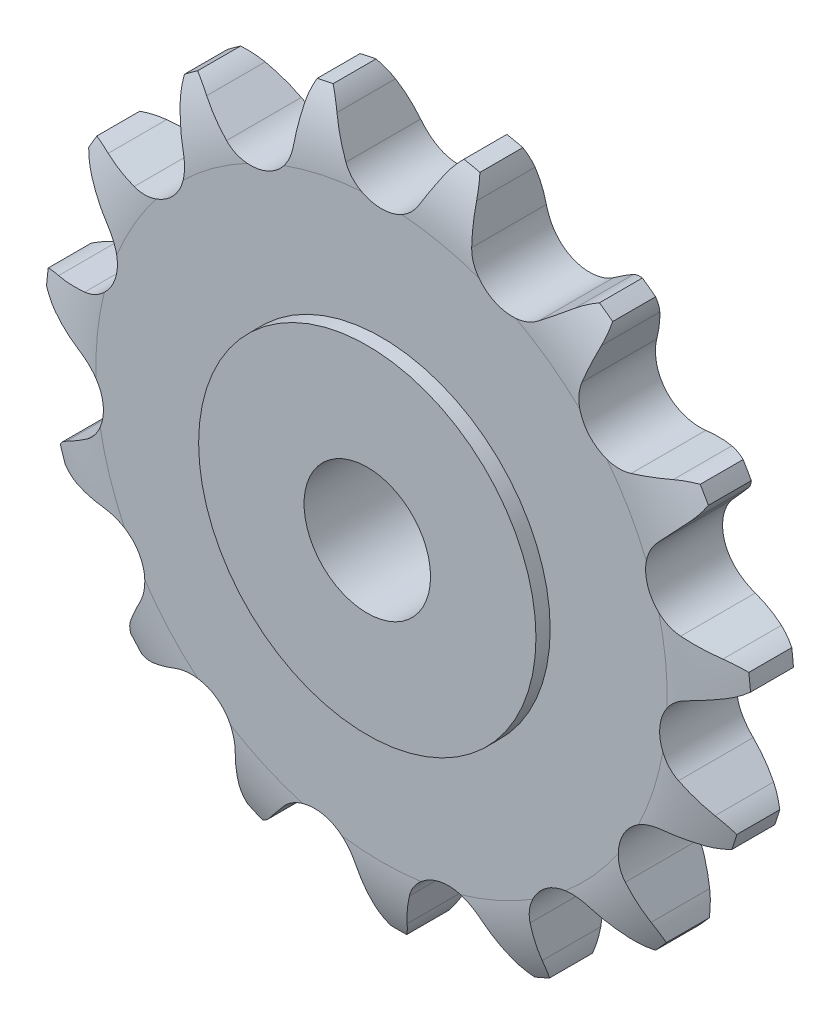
from build123d import *

# Parameters (mm, degrees)
CUT_EXTRUDE_1_DEPTH      = 48.639269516
CUT_EXTRUDE_1_DEPTH_BACK = 48.639269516


with BuildPart() as part:
    # Sketch 1 → Revolve 1 (revolve)
    with BuildSketch(Plane(origin=(0, 0, 0), x_dir=(0, 0, -1), z_dir=(1, 0, 0)), mode=Mode.PRIVATE) as revolve_1_sk:
        with BuildLine():
            Line((3.65, 16), (3.65, 27.1))
            ThreePointArc((3.65, 27.1), (3.240423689, 30.400122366), (2.036547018, 33.5))
            Line((2.036547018, 33.5), (-2.036547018, 33.5))
            ThreePointArc((-2.036547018, 33.5), (-3.240423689, 30.400122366), (-3.65, 27.1))
            Line((-3.65, 27.1), (-3.65, 16))
            Line((-3.65, 16), (-5, 16))
            Line((-5, 16), (-5, 6))
            Line((-5, 6), (5, 6))
            Line((5, 6), (5, 16))
            Line((5, 16), (3.65, 16))
        make_face()
    revolve(revolve_1_sk.sketch.rotate(Axis((0, 0, 10), (0, 0, -1)), 90), axis=Axis((0, 0, 10), (0, 0, -1)))

    # Sketch 2 → Cut-Extrude 1 (cut, two sides: drawn at the far end of the back side and taken through both)
    with BuildSketch(Plane.XY.offset(-CUT_EXTRUDE_1_DEPTH_BACK)):
        with BuildLine():
            Line((3.483061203, 28.585435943), (5.100746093, 31.468173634))
            ThreePointArc((5.100746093, 31.468173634), (5.602052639, 32.232532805), (6.203885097, 32.92053781))
            ThreePointArc((6.203885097, 32.92053781), (0, 33.5), (-6.203885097, 32.92053781))
            ThreePointArc((-6.203885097, 32.92053781), (-5.602052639, 32.232532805), (-5.100746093, 31.468173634))
            Line((-5.100746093, 31.468173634), (-3.483061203, 28.585435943))
            ThreePointArc((-3.483061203, 28.585435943), (0, 26.546), (3.483061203, 28.585435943))
        make_face()
        with BuildLine():
            Line((8.444809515, 27.530783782), (8.139495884, 30.822267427))
            ThreePointArc((8.139495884, 30.822267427), (7.992422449, 31.724444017), (7.722457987, 32.597755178))
            ThreePointArc((7.722457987, 32.597755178), (13.625677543, 30.603772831), (19.057520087, 27.551060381))
            ThreePointArc((19.057520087, 27.551060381), (18.227881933, 27.167323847), (17.459022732, 26.672946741))
            Line((17.459022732, 26.672946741), (14.808678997, 24.697406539))
            ThreePointArc((14.808678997, 24.697406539), (10.797230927, 24.250977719), (8.444809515, 27.530783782))
        make_face()
        with BuildLine():
            Line((-8.444809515, 27.530783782), (-8.139495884, 30.822267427))
            ThreePointArc((-8.139495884, 30.822267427), (-7.992422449, 31.724444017), (-7.722457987, 32.597755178))
            ThreePointArc((-7.722457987, 32.597755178), (-13.625677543, 30.603772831), (-19.057520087, 27.551060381))
            ThreePointArc((-19.057520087, 27.551060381), (-18.227881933, 27.167323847), (-17.459022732, 26.672946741))
            Line((-17.459022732, 26.672946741), (-14.808678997, 24.697406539))
            ThreePointArc((-14.808678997, 24.697406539), (-10.797230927, 24.250977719), (-8.444809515, 27.530783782))
        make_face()
        with BuildLine():
            Line((-18.91249595, 21.715808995), (-19.972345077, 24.84691117))
            ThreePointArc((-19.972345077, 24.84691117), (-20.204935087, 25.730910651), (-20.313517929, 26.638524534))
            ThreePointArc((-20.313517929, 26.638524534), (-24.895351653, 22.415875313), (-28.615936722, 17.417754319))
            ThreePointArc((-28.615936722, 17.417754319), (-27.701944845, 17.404637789), (-26.79847573, 17.26572504))
            Line((-26.79847573, 17.26572504), (-23.57374166, 16.538971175))
            ThreePointArc((-23.57374166, 16.538971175), (-19.727522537, 17.762741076), (-18.91249595, 21.715808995))
        make_face()
        with BuildLine():
            Line((-26.11004002, 12.145973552), (-28.351794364, 14.575298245))
            ThreePointArc((-28.351794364, 14.575298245), (-28.923830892, 15.288269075), (-29.392186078, 16.073250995))
            ThreePointArc((-29.392186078, 16.073250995), (-31.860393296, 10.352069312), (-33.22639793, 4.272760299))
            ThreePointArc((-33.22639793, 4.272760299), (-32.38608983, 4.632531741), (-31.504228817, 4.873102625))
            Line((-31.504228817, 4.873102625), (-28.262690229, 5.520797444))
            ThreePointArc((-28.262690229, 5.520797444), (-25.246746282, 8.203165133), (-26.11004002, 12.145973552))
        make_face()
        with BuildLine():
            Line((-28.792920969, 0.475988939), (-31.828960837, 1.78348384))
            ThreePointArc((-31.828960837, 1.78348384), (-32.641533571, 2.202146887), (-33.388678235, 2.728766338))
            ThreePointArc((-33.388678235, 2.728766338), (-33.316483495, -3.501703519), (-32.091713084, -9.611032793))
            ThreePointArc((-32.091713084, -9.611032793), (-31.470385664, -8.94058113), (-30.762614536, -8.362123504))
            Line((-30.762614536, -8.362123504), (-28.064762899, -6.451972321))
            ThreePointArc((-28.064762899, -6.451972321), (-26.400578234, -2.774812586), (-28.792920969, 0.475988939))
        make_face()
        with BuildLine():
            Line((-26.497244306, -11.276298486), (-29.802610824, -11.316711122))
            ThreePointArc((-29.802610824, -11.316711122), (-30.715218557, -11.264746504), (-31.611964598, -11.087546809))
            ThreePointArc((-31.611964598, -11.087546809), (-29.011851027, -16.75), (-25.408079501, -21.832991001))
            ThreePointArc((-25.408079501, -21.832991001), (-25.113165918, -20.967786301), (-24.701864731, -20.151462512))
            Line((-24.701864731, -20.151462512), (-23.014183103, -17.309137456))
            ThreePointArc((-23.014183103, -17.309137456), (-22.989510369, -13.273), (-26.497244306, -11.276298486))
        make_face()
        with BuildLine():
            Line((-19.619953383, -21.078811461), (-22.623118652, -22.460143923))
            ThreePointArc((-22.623118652, -22.460143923), (-23.477963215, -22.783862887), (-24.369255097, -22.986722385))
            ThreePointArc((-24.369255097, -22.986722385), (-19.690805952, -27.102069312), (-14.331158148, -30.279826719))
            ThreePointArc((-14.331158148, -30.279826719), (-14.413651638, -29.369470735), (-14.369938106, -28.456430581))
            Line((-14.369938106, -28.456430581), (-13.984241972, -25.173395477))
            ThreePointArc((-13.984241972, -25.173395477), (-15.603347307, -21.476165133), (-19.619953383, -21.078811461))
        make_face()
        with BuildLine():
            Line((-9.350194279, -27.236606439), (-11.53188374, -29.720013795))
            ThreePointArc((-11.53188374, -29.720013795), (-12.181154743, -30.363442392), (-12.912880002, -30.911284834))
            ThreePointArc((-12.912880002, -30.911284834), (-6.965041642, -32.767944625), (-0.776249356, -33.491005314))
            ThreePointArc((-0.776249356, -33.491005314), (-1.221886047, -32.692906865), (-1.553318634, -31.841023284))
            Line((-1.553318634, -31.841023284), (-2.53629836, -28.684944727))
            ThreePointArc((-2.53629836, -28.684944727), (-5.519223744, -25.965906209), (-9.350194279, -27.236606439))
        make_face()
        with BuildLine():
            Line((2.53629836, -28.684944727), (1.553318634, -31.841023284))
            ThreePointArc((1.553318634, -31.841023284), (1.221886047, -32.692906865), (0.776249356, -33.491005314))
            ThreePointArc((0.776249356, -33.491005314), (6.965041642, -32.767944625), (12.912880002, -30.911284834))
            ThreePointArc((12.912880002, -30.911284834), (12.181154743, -30.363442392), (11.53188374, -29.720013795))
            Line((11.53188374, -29.720013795), (9.350194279, -27.236606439))
            ThreePointArc((9.350194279, -27.236606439), (5.519223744, -25.965906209), (2.53629836, -28.684944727))
        make_face()
        with BuildLine():
            Line((13.984241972, -25.173395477), (14.369938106, -28.456430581))
            ThreePointArc((14.369938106, -28.456430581), (14.413651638, -29.369470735), (14.331158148, -30.279826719))
            ThreePointArc((14.331158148, -30.279826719), (19.690805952, -27.102069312), (24.369255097, -22.986722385))
            ThreePointArc((24.369255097, -22.986722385), (23.477963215, -22.783862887), (22.623118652, -22.460143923))
            Line((22.623118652, -22.460143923), (19.619953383, -21.078811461))
            ThreePointArc((19.619953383, -21.078811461), (15.603347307, -21.476165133), (13.984241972, -25.173395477))
        make_face()
        with BuildLine():
            Line((23.014183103, -17.309137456), (24.701864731, -20.151462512))
            ThreePointArc((24.701864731, -20.151462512), (25.113165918, -20.967786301), (25.408079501, -21.832991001))
            ThreePointArc((25.408079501, -21.832991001), (29.011851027, -16.75), (31.611964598, -11.087546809))
            ThreePointArc((31.611964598, -11.087546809), (30.715218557, -11.264746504), (29.802610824, -11.316711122))
            Line((29.802610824, -11.316711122), (26.497244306, -11.276298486))
            ThreePointArc((26.497244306, -11.276298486), (22.989510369, -13.273), (23.014183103, -17.309137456))
        make_face()
        with BuildLine():
            Line((28.064762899, -6.451972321), (30.762614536, -8.362123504))
            ThreePointArc((30.762614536, -8.362123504), (31.470385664, -8.94058113), (32.091713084, -9.611032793))
            ThreePointArc((32.091713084, -9.611032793), (33.316483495, -3.501703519), (33.388678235, 2.728766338))
            ThreePointArc((33.388678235, 2.728766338), (32.641533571, 2.202146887), (31.828960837, 1.78348384))
            Line((31.828960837, 1.78348384), (28.792920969, 0.475988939))
            ThreePointArc((28.792920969, 0.475988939), (26.400578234, -2.774812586), (28.064762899, -6.451972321))
        make_face()
        with BuildLine():
            Line((28.262690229, 5.520797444), (31.504228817, 4.873102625))
            ThreePointArc((31.504228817, 4.873102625), (32.38608983, 4.632531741), (33.22639793, 4.272760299))
            ThreePointArc((33.22639793, 4.272760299), (31.860393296, 10.352069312), (29.392186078, 16.073250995))
            ThreePointArc((29.392186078, 16.073250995), (28.923830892, 15.288269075), (28.351794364, 14.575298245))
            Line((28.351794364, 14.575298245), (26.11004002, 12.145973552))
            ThreePointArc((26.11004002, 12.145973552), (25.246746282, 8.203165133), (28.262690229, 5.520797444))
        make_face()
        with BuildLine():
            Line((23.57374166, 16.538971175), (26.79847573, 17.26572504))
            ThreePointArc((26.79847573, 17.26572504), (27.701944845, 17.404637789), (28.615936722, 17.417754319))
            ThreePointArc((28.615936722, 17.417754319), (24.895351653, 22.415875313), (20.313517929, 26.638524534))
            ThreePointArc((20.313517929, 26.638524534), (20.204935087, 25.730910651), (19.972345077, 24.84691117))
            Line((19.972345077, 24.84691117), (18.91249595, 21.715808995))
            ThreePointArc((18.91249595, 21.715808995), (19.727522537, 17.762741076), (23.57374166, 16.538971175))
        make_face()
    extrude(amount=CUT_EXTRUDE_1_DEPTH + CUT_EXTRUDE_1_DEPTH_BACK, mode=Mode.SUBTRACT)


solid = part.part
